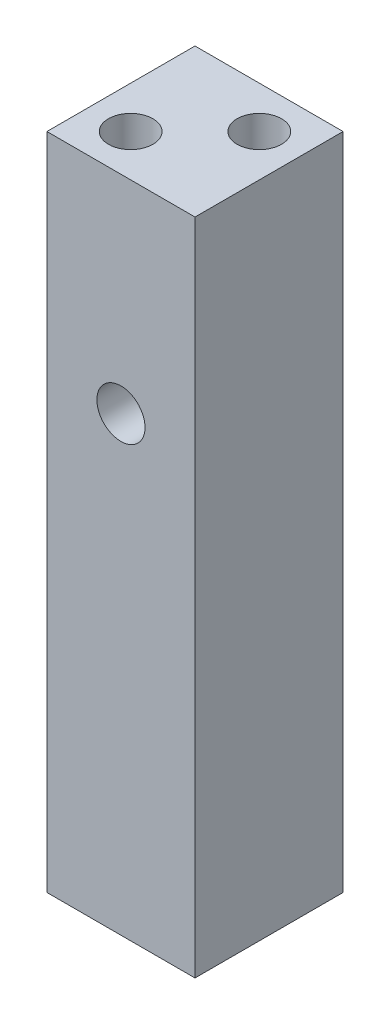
ISO-10303-21;
HEADER;
FILE_DESCRIPTION(('STEP AP214'),'2;1');
FILE_NAME('part.step','',(''),(''),'','','');
FILE_SCHEMA(('AUTOMOTIVE_DESIGN { 1 0 10303 214 1 1 1 1 }'));
ENDSEC;
DATA;
#1=APPLICATION_CONTEXT('core data for automotive mechanical design processes');
#2=APPLICATION_PROTOCOL_DEFINITION('international standard','automotive_design',2000,#1);
#3=PRODUCT_CONTEXT('',#1,'mechanical');
#4=PRODUCT('Part','Part','',(#3));
#5=PRODUCT_RELATED_PRODUCT_CATEGORY('part','',(#4));
#6=PRODUCT_DEFINITION_FORMATION('','',#4);
#7=PRODUCT_DEFINITION_CONTEXT('part definition',#1,'design');
#8=PRODUCT_DEFINITION('design','',#6,#7);
#9=PRODUCT_DEFINITION_SHAPE('','',#8);
#10=(LENGTH_UNIT() NAMED_UNIT(*) SI_UNIT(.MILLI.,.METRE.));
#11=(NAMED_UNIT(*) PLANE_ANGLE_UNIT() SI_UNIT($,.RADIAN.));
#12=(NAMED_UNIT(*) SI_UNIT($,.STERADIAN.) SOLID_ANGLE_UNIT());
#13=UNCERTAINTY_MEASURE_WITH_UNIT(LENGTH_MEASURE(1.E-05),#10,'distance_accuracy_value','');
#14=(GEOMETRIC_REPRESENTATION_CONTEXT(3) GLOBAL_UNCERTAINTY_ASSIGNED_CONTEXT((#13)) GLOBAL_UNIT_ASSIGNED_CONTEXT((#10,
#11,#12)) REPRESENTATION_CONTEXT('',''));
#15=CARTESIAN_POINT('',(0.,0.,0.));
#16=DIRECTION('',(0.,0.,1.));
#17=DIRECTION('',(1.,0.,0.));
#18=AXIS2_PLACEMENT_3D('',#15,#16,#17);
#19=CARTESIAN_POINT('',(0.,89.,0.));
#20=DIRECTION('',(1.,0.,0.));
#21=DIRECTION('',(0.,0.,-1.));
#22=AXIS2_PLACEMENT_3D('',#19,#20,#21);
#23=PLANE('',#22);
#24=DIRECTION('',(0.,0.,1.));
#25=VECTOR('',#24,1.);
#26=CARTESIAN_POINT('',(0.,0.,0.));
#27=LINE('',#26,#25);
#28=CARTESIAN_POINT('',(0.,0.,-20.));
#29=VERTEX_POINT('',#28);
#30=CARTESIAN_POINT('',(0.,0.,0.));
#31=VERTEX_POINT('',#30);
#32=EDGE_CURVE('E144',#29,#31,#27,.T.);
#33=ORIENTED_EDGE('',*,*,#32,.T.);
#34=DIRECTION('',(0.,-1.,0.));
#35=VECTOR('',#34,1.);
#36=CARTESIAN_POINT('',(0.,89.,0.));
#37=LINE('',#36,#35);
#38=CARTESIAN_POINT('',(0.,89.,0.));
#39=VERTEX_POINT('',#38);
#40=EDGE_CURVE('E11',#39,#31,#37,.T.);
#41=ORIENTED_EDGE('',*,*,#40,.F.);
#42=DIRECTION('',(0.,0.,1.));
#43=VECTOR('',#42,1.);
#44=CARTESIAN_POINT('',(0.,89.,0.));
#45=LINE('',#44,#43);
#46=CARTESIAN_POINT('',(0.,89.,-20.));
#47=VERTEX_POINT('',#46);
#48=EDGE_CURVE('E145',#47,#39,#45,.T.);
#49=ORIENTED_EDGE('',*,*,#48,.F.);
#50=DIRECTION('',(0.,-1.,0.));
#51=VECTOR('',#50,1.);
#52=CARTESIAN_POINT('',(0.,89.,-20.));
#53=LINE('',#52,#51);
#54=EDGE_CURVE('E151',#47,#29,#53,.T.);
#55=ORIENTED_EDGE('',*,*,#54,.T.);
#56=EDGE_LOOP('',(#33,#41,#49,#55));
#57=FACE_BOUND('',#56,.T.);
#58=ADVANCED_FACE('F31',(#57),#23,.F.);
#59=CARTESIAN_POINT('',(0.,89.,0.));
#60=DIRECTION('',(0.,0.,-1.));
#61=DIRECTION('',(-1.,0.,0.));
#62=AXIS2_PLACEMENT_3D('',#59,#60,#61);
#63=PLANE('',#62);
#64=CARTESIAN_POINT('',(10.,61.,0.));
#65=DIRECTION('',(0.,0.,1.));
#66=DIRECTION('',(1.,0.,0.));
#67=AXIS2_PLACEMENT_3D('',#64,#65,#66);
#68=CIRCLE('',#67,3.25);
#69=CARTESIAN_POINT('',(13.25,61.,0.));
#70=VERTEX_POINT('',#69);
#71=EDGE_CURVE('E194',#70,#70,#68,.T.);
#72=ORIENTED_EDGE('',*,*,#71,.F.);
#73=EDGE_LOOP('',(#72));
#74=FACE_BOUND('',#73,.T.);
#75=DIRECTION('',(1.,0.,0.));
#76=VECTOR('',#75,1.);
#77=CARTESIAN_POINT('',(0.,0.,0.));
#78=LINE('',#77,#76);
#79=CARTESIAN_POINT('',(20.,0.,0.));
#80=VERTEX_POINT('',#79);
#81=EDGE_CURVE('E154',#31,#80,#78,.T.);
#82=ORIENTED_EDGE('',*,*,#81,.T.);
#83=DIRECTION('',(0.,-1.,0.));
#84=VECTOR('',#83,1.);
#85=CARTESIAN_POINT('',(20.,89.,0.));
#86=LINE('',#85,#84);
#87=CARTESIAN_POINT('',(20.,89.,0.));
#88=VERTEX_POINT('',#87);
#89=EDGE_CURVE('E39',#88,#80,#86,.T.);
#90=ORIENTED_EDGE('',*,*,#89,.F.);
#91=DIRECTION('',(1.,0.,0.));
#92=VECTOR('',#91,1.);
#93=CARTESIAN_POINT('',(0.,89.,0.));
#94=LINE('',#93,#92);
#95=EDGE_CURVE('E78',#39,#88,#94,.T.);
#96=ORIENTED_EDGE('',*,*,#95,.F.);
#97=ORIENTED_EDGE('',*,*,#40,.T.);
#98=EDGE_LOOP('',(#82,#90,#96,#97));
#99=FACE_BOUND('',#98,.T.);
#100=ADVANCED_FACE('F181',(#74,#99),#63,.F.);
#101=CARTESIAN_POINT('',(20.,89.,0.));
#102=DIRECTION('',(-1.,0.,0.));
#103=DIRECTION('',(0.,0.,1.));
#104=AXIS2_PLACEMENT_3D('',#101,#102,#103);
#105=PLANE('',#104);
#106=DIRECTION('',(0.,0.,-1.));
#107=VECTOR('',#106,1.);
#108=CARTESIAN_POINT('',(20.,0.,0.));
#109=LINE('',#108,#107);
#110=CARTESIAN_POINT('',(20.,0.,-20.));
#111=VERTEX_POINT('',#110);
#112=EDGE_CURVE('E65',#80,#111,#109,.T.);
#113=ORIENTED_EDGE('',*,*,#112,.T.);
#114=DIRECTION('',(0.,-1.,0.));
#115=VECTOR('',#114,1.);
#116=CARTESIAN_POINT('',(20.,89.,-20.));
#117=LINE('',#116,#115);
#118=CARTESIAN_POINT('',(20.,89.,-20.));
#119=VERTEX_POINT('',#118);
#120=EDGE_CURVE('E159',#119,#111,#117,.T.);
#121=ORIENTED_EDGE('',*,*,#120,.F.);
#122=DIRECTION('',(0.,0.,-1.));
#123=VECTOR('',#122,1.);
#124=CARTESIAN_POINT('',(20.,89.,0.));
#125=LINE('',#124,#123);
#126=EDGE_CURVE('E148',#88,#119,#125,.T.);
#127=ORIENTED_EDGE('',*,*,#126,.F.);
#128=ORIENTED_EDGE('',*,*,#89,.T.);
#129=EDGE_LOOP('',(#113,#121,#127,#128));
#130=FACE_BOUND('',#129,.T.);
#131=ADVANCED_FACE('F161',(#130),#105,.F.);
#132=CARTESIAN_POINT('',(0.,89.,-20.));
#133=DIRECTION('',(0.,0.,1.));
#134=DIRECTION('',(1.,0.,0.));
#135=AXIS2_PLACEMENT_3D('',#132,#133,#134);
#136=PLANE('',#135);
#137=CARTESIAN_POINT('',(10.,61.,-20.));
#138=DIRECTION('',(0.,0.,1.));
#139=DIRECTION('',(1.,0.,0.));
#140=AXIS2_PLACEMENT_3D('',#137,#138,#139);
#141=CIRCLE('',#140,3.25);
#142=CARTESIAN_POINT('',(13.25,61.,-20.));
#143=VERTEX_POINT('',#142);
#144=EDGE_CURVE('E196',#143,#143,#141,.T.);
#145=ORIENTED_EDGE('',*,*,#144,.T.);
#146=EDGE_LOOP('',(#145));
#147=FACE_BOUND('',#146,.T.);
#148=DIRECTION('',(-1.,0.,0.));
#149=VECTOR('',#148,1.);
#150=CARTESIAN_POINT('',(0.,0.,-20.));
#151=LINE('',#150,#149);
#152=EDGE_CURVE('E71',#111,#29,#151,.T.);
#153=ORIENTED_EDGE('',*,*,#152,.T.);
#154=ORIENTED_EDGE('',*,*,#54,.F.);
#155=DIRECTION('',(-1.,0.,0.));
#156=VECTOR('',#155,1.);
#157=CARTESIAN_POINT('',(0.,89.,-20.));
#158=LINE('',#157,#156);
#159=EDGE_CURVE('E47',#119,#47,#158,.T.);
#160=ORIENTED_EDGE('',*,*,#159,.F.);
#161=ORIENTED_EDGE('',*,*,#120,.T.);
#162=EDGE_LOOP('',(#153,#154,#160,#161));
#163=FACE_BOUND('',#162,.T.);
#164=ADVANCED_FACE('F168',(#147,#163),#136,.F.);
#165=CARTESIAN_POINT('',(0.,89.,-20.));
#166=DIRECTION('',(0.,-1.,0.));
#167=DIRECTION('',(0.,0.,-1.));
#168=AXIS2_PLACEMENT_3D('',#165,#166,#167);
#169=PLANE('',#168);
#170=CARTESIAN_POINT('',(5.65685424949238,89.,-5.65685424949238));
#171=DIRECTION('',(0.,1.,0.));
#172=DIRECTION('',(0.,0.,1.));
#173=AXIS2_PLACEMENT_3D('',#170,#171,#172);
#174=CIRCLE('',#173,3.);
#175=CARTESIAN_POINT('',(5.65685424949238,89.,-2.65685424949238));
#176=VERTEX_POINT('',#175);
#177=EDGE_CURVE('E120',#176,#176,#174,.T.);
#178=ORIENTED_EDGE('',*,*,#177,.F.);
#179=EDGE_LOOP('',(#178));
#180=FACE_BOUND('',#179,.T.);
#181=CARTESIAN_POINT('',(14.3431457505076,89.,-14.3431457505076));
#182=DIRECTION('',(0.,1.,0.));
#183=DIRECTION('',(0.,0.,1.));
#184=AXIS2_PLACEMENT_3D('',#181,#182,#183);
#185=CIRCLE('',#184,3.);
#186=CARTESIAN_POINT('',(14.3431457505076,89.,-11.3431457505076));
#187=VERTEX_POINT('',#186);
#188=EDGE_CURVE('E132',#187,#187,#185,.T.);
#189=ORIENTED_EDGE('',*,*,#188,.F.);
#190=EDGE_LOOP('',(#189));
#191=FACE_BOUND('',#190,.T.);
#192=ORIENTED_EDGE('',*,*,#48,.T.);
#193=ORIENTED_EDGE('',*,*,#95,.T.);
#194=ORIENTED_EDGE('',*,*,#126,.T.);
#195=ORIENTED_EDGE('',*,*,#159,.T.);
#196=EDGE_LOOP('',(#192,#193,#194,#195));
#197=FACE_BOUND('',#196,.T.);
#198=ADVANCED_FACE('F170',(#180,#191,#197),#169,.F.);
#199=CARTESIAN_POINT('',(0.,0.,-20.));
#200=DIRECTION('',(0.,-1.,0.));
#201=DIRECTION('',(0.,0.,-1.));
#202=AXIS2_PLACEMENT_3D('',#199,#200,#201);
#203=PLANE('',#202);
#204=CARTESIAN_POINT('',(5.65685424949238,0.,-5.65685424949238));
#205=DIRECTION('',(0.,-1.,0.));
#206=DIRECTION('',(0.,0.,-1.));
#207=AXIS2_PLACEMENT_3D('',#204,#205,#206);
#208=CIRCLE('',#207,3.);
#209=CARTESIAN_POINT('',(5.65685424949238,0.,-8.65685424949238));
#210=VERTEX_POINT('',#209);
#211=EDGE_CURVE('E198',#210,#210,#208,.T.);
#212=ORIENTED_EDGE('',*,*,#211,.F.);
#213=EDGE_LOOP('',(#212));
#214=FACE_BOUND('',#213,.T.);
#215=CARTESIAN_POINT('',(14.3431457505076,0.,-14.3431457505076));
#216=DIRECTION('',(0.,-1.,0.));
#217=DIRECTION('',(0.,0.,-1.));
#218=AXIS2_PLACEMENT_3D('',#215,#216,#217);
#219=CIRCLE('',#218,3.);
#220=CARTESIAN_POINT('',(14.3431457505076,0.,-17.3431457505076));
#221=VERTEX_POINT('',#220);
#222=EDGE_CURVE('E101',#221,#221,#219,.T.);
#223=ORIENTED_EDGE('',*,*,#222,.F.);
#224=EDGE_LOOP('',(#223));
#225=FACE_BOUND('',#224,.T.);
#226=ORIENTED_EDGE('',*,*,#32,.F.);
#227=ORIENTED_EDGE('',*,*,#152,.F.);
#228=ORIENTED_EDGE('',*,*,#112,.F.);
#229=ORIENTED_EDGE('',*,*,#81,.F.);
#230=EDGE_LOOP('',(#226,#227,#228,#229));
#231=FACE_BOUND('',#230,.T.);
#232=ADVANCED_FACE('F164',(#214,#225,#231),#203,.T.);
#233=CARTESIAN_POINT('',(14.3431457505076,79.,-14.3431457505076));
#234=DIRECTION('',(0.,1.,0.));
#235=DIRECTION('',(0.,0.,1.));
#236=AXIS2_PLACEMENT_3D('',#233,#234,#235);
#237=CONICAL_SURFACE('',#236,2.5,1.02974425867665);
#238=CARTESIAN_POINT('',(14.3431457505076,77.4978484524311,-14.3431457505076));
#239=VERTEX_POINT('',#238);
#240=VERTEX_LOOP('',#239);
#241=FACE_BOUND('',#240,.T.);
#242=CARTESIAN_POINT('',(14.3431457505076,79.,-14.3431457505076));
#243=DIRECTION('',(0.,1.,0.));
#244=DIRECTION('',(0.,0.,1.));
#245=AXIS2_PLACEMENT_3D('',#242,#243,#244);
#246=CIRCLE('',#245,2.5);
#247=CARTESIAN_POINT('',(14.3431457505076,79.,-11.8431457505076));
#248=VERTEX_POINT('',#247);
#249=EDGE_CURVE('E141',#248,#248,#246,.T.);
#250=ORIENTED_EDGE('',*,*,#249,.T.);
#251=EDGE_LOOP('',(#250));
#252=FACE_BOUND('',#251,.T.);
#253=ADVANCED_FACE('F216',(#241,#252),#237,.F.);
#254=CARTESIAN_POINT('',(14.3431457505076,89.,-14.3431457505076));
#255=DIRECTION('',(0.,1.,0.));
#256=DIRECTION('',(0.,0.,1.));
#257=AXIS2_PLACEMENT_3D('',#254,#255,#256);
#258=CYLINDRICAL_SURFACE('',#257,2.5);
#259=ORIENTED_EDGE('',*,*,#249,.F.);
#260=EDGE_LOOP('',(#259));
#261=FACE_BOUND('',#260,.T.);
#262=CARTESIAN_POINT('',(14.3431457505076,77.,-14.3431457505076));
#263=DIRECTION('',(0.,1.,0.));
#264=DIRECTION('',(0.,0.,1.));
#265=AXIS2_PLACEMENT_3D('',#262,#263,#264);
#266=CIRCLE('',#265,2.5);
#267=CARTESIAN_POINT('',(14.3431457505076,77.,-11.8431457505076));
#268=VERTEX_POINT('',#267);
#269=EDGE_CURVE('E138',#268,#268,#266,.T.);
#270=ORIENTED_EDGE('',*,*,#269,.T.);
#271=EDGE_LOOP('',(#270));
#272=FACE_BOUND('',#271,.T.);
#273=ADVANCED_FACE('F262',(#261,#272),#258,.T.);
#274=CARTESIAN_POINT('',(16.8431457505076,77.,-14.3431457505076));
#275=DIRECTION('',(0.,-1.,0.));
#276=DIRECTION('',(0.,0.,-1.));
#277=AXIS2_PLACEMENT_3D('',#274,#275,#276);
#278=PLANE('',#277);
#279=ORIENTED_EDGE('',*,*,#269,.F.);
#280=EDGE_LOOP('',(#279));
#281=FACE_BOUND('',#280,.T.);
#282=CARTESIAN_POINT('',(14.3431457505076,77.,-14.3431457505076));
#283=DIRECTION('',(0.,1.,0.));
#284=DIRECTION('',(0.,0.,1.));
#285=AXIS2_PLACEMENT_3D('',#282,#283,#284);
#286=CIRCLE('',#285,3.);
#287=CARTESIAN_POINT('',(14.3431457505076,77.,-11.3431457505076));
#288=VERTEX_POINT('',#287);
#289=EDGE_CURVE('E135',#288,#288,#286,.T.);
#290=ORIENTED_EDGE('',*,*,#289,.T.);
#291=EDGE_LOOP('',(#290));
#292=FACE_BOUND('',#291,.T.);
#293=ADVANCED_FACE('F258',(#281,#292),#278,.F.);
#294=CARTESIAN_POINT('',(14.3431457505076,89.,-14.3431457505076));
#295=DIRECTION('',(0.,1.,0.));
#296=DIRECTION('',(0.,0.,1.));
#297=AXIS2_PLACEMENT_3D('',#294,#295,#296);
#298=CYLINDRICAL_SURFACE('',#297,3.);
#299=ORIENTED_EDGE('',*,*,#289,.F.);
#300=EDGE_LOOP('',(#299));
#301=FACE_BOUND('',#300,.T.);
#302=ORIENTED_EDGE('',*,*,#188,.T.);
#303=EDGE_LOOP('',(#302));
#304=FACE_BOUND('',#303,.T.);
#305=ADVANCED_FACE('F254',(#301,#304),#298,.F.);
#306=CARTESIAN_POINT('',(5.65685424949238,79.,-5.65685424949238));
#307=DIRECTION('',(0.,1.,0.));
#308=DIRECTION('',(0.,0.,1.));
#309=AXIS2_PLACEMENT_3D('',#306,#307,#308);
#310=CONICAL_SURFACE('',#309,2.5,1.02974425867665);
#311=CARTESIAN_POINT('',(5.65685424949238,77.4978484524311,-5.65685424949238));
#312=VERTEX_POINT('',#311);
#313=VERTEX_LOOP('',#312);
#314=FACE_BOUND('',#313,.T.);
#315=CARTESIAN_POINT('',(5.65685424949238,79.,-5.65685424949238));
#316=DIRECTION('',(0.,1.,0.));
#317=DIRECTION('',(0.,0.,1.));
#318=AXIS2_PLACEMENT_3D('',#315,#316,#317);
#319=CIRCLE('',#318,2.5);
#320=CARTESIAN_POINT('',(5.65685424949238,79.,-3.15685424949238));
#321=VERTEX_POINT('',#320);
#322=EDGE_CURVE('E129',#321,#321,#319,.T.);
#323=ORIENTED_EDGE('',*,*,#322,.T.);
#324=EDGE_LOOP('',(#323));
#325=FACE_BOUND('',#324,.T.);
#326=ADVANCED_FACE('F250',(#314,#325),#310,.F.);
#327=CARTESIAN_POINT('',(5.65685424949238,89.,-5.65685424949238));
#328=DIRECTION('',(0.,1.,0.));
#329=DIRECTION('',(0.,0.,1.));
#330=AXIS2_PLACEMENT_3D('',#327,#328,#329);
#331=CYLINDRICAL_SURFACE('',#330,2.5);
#332=ORIENTED_EDGE('',*,*,#322,.F.);
#333=EDGE_LOOP('',(#332));
#334=FACE_BOUND('',#333,.T.);
#335=CARTESIAN_POINT('',(5.65685424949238,77.,-5.65685424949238));
#336=DIRECTION('',(0.,1.,0.));
#337=DIRECTION('',(0.,0.,1.));
#338=AXIS2_PLACEMENT_3D('',#335,#336,#337);
#339=CIRCLE('',#338,2.5);
#340=CARTESIAN_POINT('',(5.65685424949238,77.,-3.15685424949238));
#341=VERTEX_POINT('',#340);
#342=EDGE_CURVE('E126',#341,#341,#339,.T.);
#343=ORIENTED_EDGE('',*,*,#342,.T.);
#344=EDGE_LOOP('',(#343));
#345=FACE_BOUND('',#344,.T.);
#346=ADVANCED_FACE('F246',(#334,#345),#331,.T.);
#347=CARTESIAN_POINT('',(8.15685424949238,77.,-5.65685424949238));
#348=DIRECTION('',(0.,-1.,0.));
#349=DIRECTION('',(0.,0.,-1.));
#350=AXIS2_PLACEMENT_3D('',#347,#348,#349);
#351=PLANE('',#350);
#352=ORIENTED_EDGE('',*,*,#342,.F.);
#353=EDGE_LOOP('',(#352));
#354=FACE_BOUND('',#353,.T.);
#355=CARTESIAN_POINT('',(5.65685424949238,77.,-5.65685424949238));
#356=DIRECTION('',(0.,1.,0.));
#357=DIRECTION('',(0.,0.,1.));
#358=AXIS2_PLACEMENT_3D('',#355,#356,#357);
#359=CIRCLE('',#358,3.);
#360=CARTESIAN_POINT('',(5.65685424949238,77.,-2.65685424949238));
#361=VERTEX_POINT('',#360);
#362=EDGE_CURVE('E123',#361,#361,#359,.T.);
#363=ORIENTED_EDGE('',*,*,#362,.T.);
#364=EDGE_LOOP('',(#363));
#365=FACE_BOUND('',#364,.T.);
#366=ADVANCED_FACE('F242',(#354,#365),#351,.F.);
#367=CARTESIAN_POINT('',(5.65685424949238,89.,-5.65685424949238));
#368=DIRECTION('',(0.,1.,0.));
#369=DIRECTION('',(0.,0.,1.));
#370=AXIS2_PLACEMENT_3D('',#367,#368,#369);
#371=CYLINDRICAL_SURFACE('',#370,3.);
#372=ORIENTED_EDGE('',*,*,#362,.F.);
#373=EDGE_LOOP('',(#372));
#374=FACE_BOUND('',#373,.T.);
#375=ORIENTED_EDGE('',*,*,#177,.T.);
#376=EDGE_LOOP('',(#375));
#377=FACE_BOUND('',#376,.T.);
#378=ADVANCED_FACE('F238',(#374,#377),#371,.F.);
#379=CARTESIAN_POINT('',(14.3431457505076,10.,-14.3431457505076));
#380=DIRECTION('',(0.,-1.,0.));
#381=DIRECTION('',(0.,0.,-1.));
#382=AXIS2_PLACEMENT_3D('',#379,#380,#381);
#383=CONICAL_SURFACE('',#382,2.5,1.02974425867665);
#384=CARTESIAN_POINT('',(14.3431457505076,11.5021515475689,-14.3431457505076));
#385=VERTEX_POINT('',#384);
#386=VERTEX_LOOP('',#385);
#387=FACE_BOUND('',#386,.T.);
#388=CARTESIAN_POINT('',(14.3431457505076,10.,-14.3431457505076));
#389=DIRECTION('',(0.,-1.,0.));
#390=DIRECTION('',(0.,0.,-1.));
#391=AXIS2_PLACEMENT_3D('',#388,#389,#390);
#392=CIRCLE('',#391,2.5);
#393=CARTESIAN_POINT('',(14.3431457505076,10.,-16.8431457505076));
#394=VERTEX_POINT('',#393);
#395=EDGE_CURVE('E117',#394,#394,#392,.T.);
#396=ORIENTED_EDGE('',*,*,#395,.T.);
#397=EDGE_LOOP('',(#396));
#398=FACE_BOUND('',#397,.T.);
#399=ADVANCED_FACE('F234',(#387,#398),#383,.F.);
#400=CARTESIAN_POINT('',(14.3431457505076,0.,-14.3431457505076));
#401=DIRECTION('',(0.,-1.,0.));
#402=DIRECTION('',(0.,0.,-1.));
#403=AXIS2_PLACEMENT_3D('',#400,#401,#402);
#404=CYLINDRICAL_SURFACE('',#403,2.5);
#405=ORIENTED_EDGE('',*,*,#395,.F.);
#406=EDGE_LOOP('',(#405));
#407=FACE_BOUND('',#406,.T.);
#408=CARTESIAN_POINT('',(14.3431457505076,12.,-14.3431457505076));
#409=DIRECTION('',(0.,-1.,0.));
#410=DIRECTION('',(0.,0.,-1.));
#411=AXIS2_PLACEMENT_3D('',#408,#409,#410);
#412=CIRCLE('',#411,2.5);
#413=CARTESIAN_POINT('',(14.3431457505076,12.,-16.8431457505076));
#414=VERTEX_POINT('',#413);
#415=EDGE_CURVE('E114',#414,#414,#412,.T.);
#416=ORIENTED_EDGE('',*,*,#415,.T.);
#417=EDGE_LOOP('',(#416));
#418=FACE_BOUND('',#417,.T.);
#419=ADVANCED_FACE('F226',(#407,#418),#404,.T.);
#420=CARTESIAN_POINT('',(16.8431457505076,12.,-14.3431457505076));
#421=DIRECTION('',(0.,1.,0.));
#422=DIRECTION('',(0.,0.,1.));
#423=AXIS2_PLACEMENT_3D('',#420,#421,#422);
#424=PLANE('',#423);
#425=ORIENTED_EDGE('',*,*,#415,.F.);
#426=EDGE_LOOP('',(#425));
#427=FACE_BOUND('',#426,.T.);
#428=CARTESIAN_POINT('',(14.3431457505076,12.,-14.3431457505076));
#429=DIRECTION('',(0.,-1.,0.));
#430=DIRECTION('',(0.,0.,-1.));
#431=AXIS2_PLACEMENT_3D('',#428,#429,#430);
#432=CIRCLE('',#431,3.);
#433=CARTESIAN_POINT('',(14.3431457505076,12.,-17.3431457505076));
#434=VERTEX_POINT('',#433);
#435=EDGE_CURVE('E105',#434,#434,#432,.T.);
#436=ORIENTED_EDGE('',*,*,#435,.T.);
#437=EDGE_LOOP('',(#436));
#438=FACE_BOUND('',#437,.T.);
#439=ADVANCED_FACE('F220',(#427,#438),#424,.F.);
#440=CARTESIAN_POINT('',(14.3431457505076,0.,-14.3431457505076));
#441=DIRECTION('',(0.,-1.,0.));
#442=DIRECTION('',(0.,0.,-1.));
#443=AXIS2_PLACEMENT_3D('',#440,#441,#442);
#444=CYLINDRICAL_SURFACE('',#443,3.);
#445=ORIENTED_EDGE('',*,*,#435,.F.);
#446=EDGE_LOOP('',(#445));
#447=FACE_BOUND('',#446,.T.);
#448=ORIENTED_EDGE('',*,*,#222,.T.);
#449=EDGE_LOOP('',(#448));
#450=FACE_BOUND('',#449,.T.);
#451=ADVANCED_FACE('F95',(#447,#450),#444,.F.);
#452=CARTESIAN_POINT('',(5.65685424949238,10.,-5.65685424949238));
#453=DIRECTION('',(0.,-1.,0.));
#454=DIRECTION('',(0.,0.,-1.));
#455=AXIS2_PLACEMENT_3D('',#452,#453,#454);
#456=CONICAL_SURFACE('',#455,2.5,1.02974425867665);
#457=CARTESIAN_POINT('',(5.65685424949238,11.5021515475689,-5.65685424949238));
#458=VERTEX_POINT('',#457);
#459=VERTEX_LOOP('',#458);
#460=FACE_BOUND('',#459,.T.);
#461=CARTESIAN_POINT('',(5.65685424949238,10.,-5.65685424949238));
#462=DIRECTION('',(0.,-1.,0.));
#463=DIRECTION('',(0.,0.,-1.));
#464=AXIS2_PLACEMENT_3D('',#461,#462,#463);
#465=CIRCLE('',#464,2.5);
#466=CARTESIAN_POINT('',(5.65685424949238,10.,-8.15685424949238));
#467=VERTEX_POINT('',#466);
#468=EDGE_CURVE('E99',#467,#467,#465,.T.);
#469=ORIENTED_EDGE('',*,*,#468,.T.);
#470=EDGE_LOOP('',(#469));
#471=FACE_BOUND('',#470,.T.);
#472=ADVANCED_FACE('F91',(#460,#471),#456,.F.);
#473=CARTESIAN_POINT('',(5.65685424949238,0.,-5.65685424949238));
#474=DIRECTION('',(0.,-1.,0.));
#475=DIRECTION('',(0.,0.,-1.));
#476=AXIS2_PLACEMENT_3D('',#473,#474,#475);
#477=CYLINDRICAL_SURFACE('',#476,2.5);
#478=ORIENTED_EDGE('',*,*,#468,.F.);
#479=EDGE_LOOP('',(#478));
#480=FACE_BOUND('',#479,.T.);
#481=CARTESIAN_POINT('',(5.65685424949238,12.,-5.65685424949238));
#482=DIRECTION('',(0.,-1.,0.));
#483=DIRECTION('',(0.,0.,-1.));
#484=AXIS2_PLACEMENT_3D('',#481,#482,#483);
#485=CIRCLE('',#484,2.5);
#486=CARTESIAN_POINT('',(5.65685424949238,12.,-8.15685424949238));
#487=VERTEX_POINT('',#486);
#488=EDGE_CURVE('E102',#487,#487,#485,.T.);
#489=ORIENTED_EDGE('',*,*,#488,.T.);
#490=EDGE_LOOP('',(#489));
#491=FACE_BOUND('',#490,.T.);
#492=ADVANCED_FACE('F94',(#480,#491),#477,.T.);
#493=CARTESIAN_POINT('',(8.15685424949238,12.,-5.65685424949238));
#494=DIRECTION('',(0.,1.,0.));
#495=DIRECTION('',(0.,0.,1.));
#496=AXIS2_PLACEMENT_3D('',#493,#494,#495);
#497=PLANE('',#496);
#498=ORIENTED_EDGE('',*,*,#488,.F.);
#499=EDGE_LOOP('',(#498));
#500=FACE_BOUND('',#499,.T.);
#501=CARTESIAN_POINT('',(5.65685424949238,12.,-5.65685424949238));
#502=DIRECTION('',(0.,-1.,0.));
#503=DIRECTION('',(0.,0.,-1.));
#504=AXIS2_PLACEMENT_3D('',#501,#502,#503);
#505=CIRCLE('',#504,3.);
#506=CARTESIAN_POINT('',(5.65685424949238,12.,-8.65685424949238));
#507=VERTEX_POINT('',#506);
#508=EDGE_CURVE('E108',#507,#507,#505,.T.);
#509=ORIENTED_EDGE('',*,*,#508,.T.);
#510=EDGE_LOOP('',(#509));
#511=FACE_BOUND('',#510,.T.);
#512=ADVANCED_FACE('F205',(#500,#511),#497,.F.);
#513=CARTESIAN_POINT('',(5.65685424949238,0.,-5.65685424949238));
#514=DIRECTION('',(0.,-1.,0.));
#515=DIRECTION('',(0.,0.,-1.));
#516=AXIS2_PLACEMENT_3D('',#513,#514,#515);
#517=CYLINDRICAL_SURFACE('',#516,3.);
#518=ORIENTED_EDGE('',*,*,#508,.F.);
#519=EDGE_LOOP('',(#518));
#520=FACE_BOUND('',#519,.T.);
#521=ORIENTED_EDGE('',*,*,#211,.T.);
#522=EDGE_LOOP('',(#521));
#523=FACE_BOUND('',#522,.T.);
#524=ADVANCED_FACE('F207',(#520,#523),#517,.F.);
#525=CARTESIAN_POINT('',(10.,61.,-20.));
#526=DIRECTION('',(0.,0.,1.));
#527=DIRECTION('',(1.,0.,0.));
#528=AXIS2_PLACEMENT_3D('',#525,#526,#527);
#529=CYLINDRICAL_SURFACE('',#528,3.25);
#530=ORIENTED_EDGE('',*,*,#144,.F.);
#531=EDGE_LOOP('',(#530));
#532=FACE_BOUND('',#531,.T.);
#533=ORIENTED_EDGE('',*,*,#71,.T.);
#534=EDGE_LOOP('',(#533));
#535=FACE_BOUND('',#534,.T.);
#536=ADVANCED_FACE('F210',(#532,#535),#529,.F.);
#537=CLOSED_SHELL('',(#58,#100,#131,#164,#198,#232,#253,#273,#293,#305,#326,#346,#366,#378,#399,
#419,#439,#451,#472,#492,#512,#524,#536));
#538=MANIFOLD_SOLID_BREP('B2',#537);
#539=ADVANCED_BREP_SHAPE_REPRESENTATION('',(#18,#538),#14);
#540=SHAPE_DEFINITION_REPRESENTATION(#9,#539);
ENDSEC;
END-ISO-10303-21;
